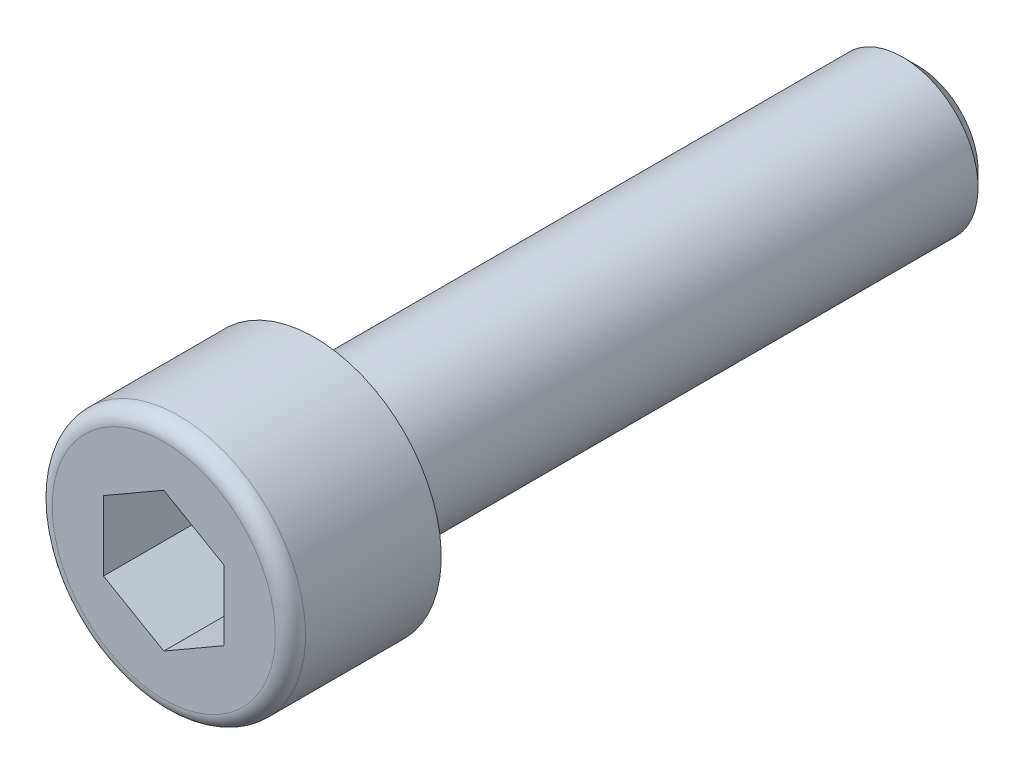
ISO-10303-21;
HEADER;
FILE_DESCRIPTION(('STEP AP214'),'2;1');
FILE_NAME('part.step','',(''),(''),'','','');
FILE_SCHEMA(('AUTOMOTIVE_DESIGN { 1 0 10303 214 1 1 1 1 }'));
ENDSEC;
DATA;
#1=APPLICATION_CONTEXT('core data for automotive mechanical design processes');
#2=APPLICATION_PROTOCOL_DEFINITION('international standard','automotive_design',2000,#1);
#3=PRODUCT_CONTEXT('',#1,'mechanical');
#4=PRODUCT('Part','Part','',(#3));
#5=PRODUCT_RELATED_PRODUCT_CATEGORY('part','',(#4));
#6=PRODUCT_DEFINITION_FORMATION('','',#4);
#7=PRODUCT_DEFINITION_CONTEXT('part definition',#1,'design');
#8=PRODUCT_DEFINITION('design','',#6,#7);
#9=PRODUCT_DEFINITION_SHAPE('','',#8);
#10=(LENGTH_UNIT() NAMED_UNIT(*) SI_UNIT(.MILLI.,.METRE.));
#11=(NAMED_UNIT(*) PLANE_ANGLE_UNIT() SI_UNIT($,.RADIAN.));
#12=(NAMED_UNIT(*) SI_UNIT($,.STERADIAN.) SOLID_ANGLE_UNIT());
#13=UNCERTAINTY_MEASURE_WITH_UNIT(LENGTH_MEASURE(1.E-05),#10,'distance_accuracy_value','');
#14=(GEOMETRIC_REPRESENTATION_CONTEXT(3) GLOBAL_UNCERTAINTY_ASSIGNED_CONTEXT((#13)) GLOBAL_UNIT_ASSIGNED_CONTEXT((#10,
#11,#12)) REPRESENTATION_CONTEXT('',''));
#15=CARTESIAN_POINT('',(0.,0.,0.));
#16=DIRECTION('',(0.,0.,1.));
#17=DIRECTION('',(1.,0.,0.));
#18=AXIS2_PLACEMENT_3D('',#15,#16,#17);
#19=CARTESIAN_POINT('',(0.,0.,0.));
#20=DIRECTION('',(0.,0.,1.));
#21=DIRECTION('',(-0.127409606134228,-0.991850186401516,0.));
#22=AXIS2_PLACEMENT_3D('',#19,#20,#21);
#23=CYLINDRICAL_SURFACE('',#22,4.2);
#24=CARTESIAN_POINT('',(0.,0.,4.5));
#25=DIRECTION('',(0.,0.,-1.));
#26=DIRECTION('',(-1.,0.,0.));
#27=AXIS2_PLACEMENT_3D('',#24,#25,#26);
#28=CIRCLE('',#27,4.2);
#29=CARTESIAN_POINT('',(-4.2,0.,4.5));
#30=VERTEX_POINT('',#29);
#31=EDGE_CURVE('E22',#30,#30,#28,.T.);
#32=ORIENTED_EDGE('',*,*,#31,.T.);
#33=EDGE_LOOP('',(#32));
#34=FACE_BOUND('',#33,.T.);
#35=CARTESIAN_POINT('',(0.,0.,0.));
#36=DIRECTION('',(0.,0.,1.));
#37=DIRECTION('',(-0.127409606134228,-0.991850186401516,0.));
#38=AXIS2_PLACEMENT_3D('',#35,#36,#37);
#39=CIRCLE('',#38,4.2);
#40=CARTESIAN_POINT('',(-0.535120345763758,-4.16577078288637,0.));
#41=VERTEX_POINT('',#40);
#42=EDGE_CURVE('E124',#41,#41,#39,.F.);
#43=ORIENTED_EDGE('',*,*,#42,.F.);
#44=EDGE_LOOP('',(#43));
#45=FACE_BOUND('',#44,.T.);
#46=ADVANCED_FACE('F14',(#34,#45),#23,.T.);
#47=CARTESIAN_POINT('',(0.,0.,0.));
#48=DIRECTION('',(0.,0.,-1.));
#49=DIRECTION('',(0.127409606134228,0.991850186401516,0.));
#50=AXIS2_PLACEMENT_3D('',#47,#48,#49);
#51=PLANE('',#50);
#52=ORIENTED_EDGE('',*,*,#42,.T.);
#53=EDGE_LOOP('',(#52));
#54=FACE_BOUND('',#53,.T.);
#55=CARTESIAN_POINT('',(0.,0.,0.));
#56=DIRECTION('',(0.,0.,-1.));
#57=DIRECTION('',(0.127409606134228,0.991850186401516,0.));
#58=AXIS2_PLACEMENT_3D('',#55,#56,#57);
#59=CIRCLE('',#58,2.5);
#60=CARTESIAN_POINT('',(0.31852401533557,2.47962546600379,0.));
#61=VERTEX_POINT('',#60);
#62=EDGE_CURVE('E116',#61,#61,#59,.T.);
#63=ORIENTED_EDGE('',*,*,#62,.F.);
#64=EDGE_LOOP('',(#63));
#65=FACE_BOUND('',#64,.T.);
#66=ADVANCED_FACE('F153',(#54,#65),#51,.T.);
#67=CARTESIAN_POINT('',(0.,0.,-20.));
#68=DIRECTION('',(0.,0.,-1.));
#69=DIRECTION('',(0.127409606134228,0.991850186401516,0.));
#70=AXIS2_PLACEMENT_3D('',#67,#68,#69);
#71=PLANE('',#70);
#72=CARTESIAN_POINT('',(0.,0.,-20.));
#73=DIRECTION('',(0.,0.,-1.));
#74=DIRECTION('',(0.127409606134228,0.991850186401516,0.));
#75=AXIS2_PLACEMENT_3D('',#72,#73,#74);
#76=CIRCLE('',#75,2.);
#77=CARTESIAN_POINT('',(0.254819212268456,1.98370037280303,-20.));
#78=VERTEX_POINT('',#77);
#79=EDGE_CURVE('E127',#78,#78,#76,.T.);
#80=ORIENTED_EDGE('',*,*,#79,.T.);
#81=EDGE_LOOP('',(#80));
#82=FACE_BOUND('',#81,.T.);
#83=ADVANCED_FACE('F155',(#82),#71,.T.);
#84=CARTESIAN_POINT('',(0.,0.,-20.));
#85=DIRECTION('',(0.,0.,1.));
#86=DIRECTION('',(-0.127409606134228,-0.991850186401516,0.));
#87=AXIS2_PLACEMENT_3D('',#84,#85,#86);
#88=CONICAL_SURFACE('',#87,2.,0.785398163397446);
#89=CARTESIAN_POINT('',(0.,0.,-19.5));
#90=DIRECTION('',(0.,0.,-1.));
#91=DIRECTION('',(0.127409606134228,0.991850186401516,0.));
#92=AXIS2_PLACEMENT_3D('',#89,#90,#91);
#93=CIRCLE('',#92,2.5);
#94=CARTESIAN_POINT('',(0.31852401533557,2.47962546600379,-19.5));
#95=VERTEX_POINT('',#94);
#96=EDGE_CURVE('E130',#95,#95,#93,.F.);
#97=ORIENTED_EDGE('',*,*,#96,.F.);
#98=EDGE_LOOP('',(#97));
#99=FACE_BOUND('',#98,.T.);
#100=ORIENTED_EDGE('',*,*,#79,.F.);
#101=EDGE_LOOP('',(#100));
#102=FACE_BOUND('',#101,.T.);
#103=ADVANCED_FACE('F163',(#99,#102),#88,.T.);
#104=CARTESIAN_POINT('',(0.,0.,-20.));
#105=DIRECTION('',(0.,0.,1.));
#106=DIRECTION('',(-0.127409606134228,-0.991850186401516,0.));
#107=AXIS2_PLACEMENT_3D('',#104,#105,#106);
#108=CYLINDRICAL_SURFACE('',#107,2.5);
#109=ORIENTED_EDGE('',*,*,#96,.T.);
#110=EDGE_LOOP('',(#109));
#111=FACE_BOUND('',#110,.T.);
#112=ORIENTED_EDGE('',*,*,#62,.T.);
#113=EDGE_LOOP('',(#112));
#114=FACE_BOUND('',#113,.T.);
#115=ADVANCED_FACE('F149',(#111,#114),#108,.T.);
#116=CARTESIAN_POINT('',(0.,0.,5.));
#117=DIRECTION('',(0.,0.,-1.));
#118=DIRECTION('',(-1.,0.,0.));
#119=AXIS2_PLACEMENT_3D('',#116,#117,#118);
#120=PLANE('',#119);
#121=DIRECTION('',(-0.866025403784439,-0.5,0.));
#122=VECTOR('',#121,1.);
#123=CARTESIAN_POINT('',(0.,2.30940107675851,5.));
#124=LINE('',#123,#122);
#125=CARTESIAN_POINT('',(0.,2.30940107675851,5.));
#126=VERTEX_POINT('',#125);
#127=CARTESIAN_POINT('',(-2.,1.15470053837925,5.));
#128=VERTEX_POINT('',#127);
#129=EDGE_CURVE('E103',#126,#128,#124,.T.);
#130=ORIENTED_EDGE('',*,*,#129,.F.);
#131=DIRECTION('',(-0.866025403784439,0.5,0.));
#132=VECTOR('',#131,1.);
#133=CARTESIAN_POINT('',(2.,1.15470053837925,5.));
#134=LINE('',#133,#132);
#135=CARTESIAN_POINT('',(2.,1.15470053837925,5.));
#136=VERTEX_POINT('',#135);
#137=EDGE_CURVE('E29',#136,#126,#134,.T.);
#138=ORIENTED_EDGE('',*,*,#137,.F.);
#139=DIRECTION('',(0.,1.,0.));
#140=VECTOR('',#139,1.);
#141=CARTESIAN_POINT('',(2.,-1.15470053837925,5.));
#142=LINE('',#141,#140);
#143=CARTESIAN_POINT('',(2.,-1.15470053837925,5.));
#144=VERTEX_POINT('',#143);
#145=EDGE_CURVE('E112',#144,#136,#142,.T.);
#146=ORIENTED_EDGE('',*,*,#145,.F.);
#147=DIRECTION('',(0.866025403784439,0.5,0.));
#148=VECTOR('',#147,1.);
#149=CARTESIAN_POINT('',(0.,-2.30940107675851,5.));
#150=LINE('',#149,#148);
#151=CARTESIAN_POINT('',(0.,-2.30940107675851,5.));
#152=VERTEX_POINT('',#151);
#153=EDGE_CURVE('E110',#152,#144,#150,.T.);
#154=ORIENTED_EDGE('',*,*,#153,.F.);
#155=DIRECTION('',(0.866025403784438,-0.5,0.));
#156=VECTOR('',#155,1.);
#157=CARTESIAN_POINT('',(-2.,-1.15470053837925,5.));
#158=LINE('',#157,#156);
#159=CARTESIAN_POINT('',(-2.,-1.15470053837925,5.));
#160=VERTEX_POINT('',#159);
#161=EDGE_CURVE('E77',#160,#152,#158,.T.);
#162=ORIENTED_EDGE('',*,*,#161,.F.);
#163=DIRECTION('',(0.,-1.,0.));
#164=VECTOR('',#163,1.);
#165=CARTESIAN_POINT('',(-2.,1.15470053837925,5.));
#166=LINE('',#165,#164);
#167=EDGE_CURVE('E106',#128,#160,#166,.T.);
#168=ORIENTED_EDGE('',*,*,#167,.F.);
#169=EDGE_LOOP('',(#130,#138,#146,#154,#162,#168));
#170=FACE_BOUND('',#169,.T.);
#171=CARTESIAN_POINT('',(0.,0.,5.));
#172=DIRECTION('',(0.,0.,-1.));
#173=DIRECTION('',(-1.,0.,0.));
#174=AXIS2_PLACEMENT_3D('',#171,#172,#173);
#175=CIRCLE('',#174,3.7);
#176=CARTESIAN_POINT('',(-3.7,0.,5.));
#177=VERTEX_POINT('',#176);
#178=EDGE_CURVE('E9',#177,#177,#175,.F.);
#179=ORIENTED_EDGE('',*,*,#178,.T.);
#180=EDGE_LOOP('',(#179));
#181=FACE_BOUND('',#180,.T.);
#182=ADVANCED_FACE('F139',(#170,#181),#120,.F.);
#183=CARTESIAN_POINT('',(0.,0.,4.5));
#184=DIRECTION('',(0.,0.,-1.));
#185=DIRECTION('',(-1.,0.,0.));
#186=AXIS2_PLACEMENT_3D('',#183,#184,#185);
#187=TOROIDAL_SURFACE('',#186,3.7,0.5);
#188=ORIENTED_EDGE('',*,*,#178,.F.);
#189=EDGE_LOOP('',(#188));
#190=FACE_BOUND('',#189,.T.);
#191=ORIENTED_EDGE('',*,*,#31,.F.);
#192=EDGE_LOOP('',(#191));
#193=FACE_BOUND('',#192,.T.);
#194=ADVANCED_FACE('F16',(#190,#193),#187,.T.);
#195=CARTESIAN_POINT('',(2.,1.15470053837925,2.));
#196=DIRECTION('',(0.5,0.866025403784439,0.));
#197=DIRECTION('',(-0.866025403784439,0.5,0.));
#198=AXIS2_PLACEMENT_3D('',#195,#196,#197);
#199=PLANE('',#198);
#200=ORIENTED_EDGE('',*,*,#137,.T.);
#201=DIRECTION('',(0.,0.,1.));
#202=VECTOR('',#201,1.);
#203=CARTESIAN_POINT('',(0.,2.30940107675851,2.));
#204=LINE('',#203,#202);
#205=CARTESIAN_POINT('',(0.,2.30940107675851,2.));
#206=VERTEX_POINT('',#205);
#207=EDGE_CURVE('E59',#206,#126,#204,.T.);
#208=ORIENTED_EDGE('',*,*,#207,.F.);
#209=DIRECTION('',(-0.866025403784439,0.5,0.));
#210=VECTOR('',#209,1.);
#211=CARTESIAN_POINT('',(2.,1.15470053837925,2.));
#212=LINE('',#211,#210);
#213=CARTESIAN_POINT('',(2.,1.15470053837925,2.));
#214=VERTEX_POINT('',#213);
#215=EDGE_CURVE('E114',#214,#206,#212,.T.);
#216=ORIENTED_EDGE('',*,*,#215,.F.);
#217=DIRECTION('',(0.,0.,1.));
#218=VECTOR('',#217,1.);
#219=CARTESIAN_POINT('',(2.,1.15470053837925,2.));
#220=LINE('',#219,#218);
#221=EDGE_CURVE('E37',#214,#136,#220,.T.);
#222=ORIENTED_EDGE('',*,*,#221,.T.);
#223=EDGE_LOOP('',(#200,#208,#216,#222));
#224=FACE_BOUND('',#223,.T.);
#225=ADVANCED_FACE('F138',(#224),#199,.F.);
#226=CARTESIAN_POINT('',(2.,-1.15470053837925,2.));
#227=DIRECTION('',(1.,0.,0.));
#228=DIRECTION('',(0.,0.,-1.));
#229=AXIS2_PLACEMENT_3D('',#226,#227,#228);
#230=PLANE('',#229);
#231=ORIENTED_EDGE('',*,*,#145,.T.);
#232=ORIENTED_EDGE('',*,*,#221,.F.);
#233=DIRECTION('',(0.,1.,0.));
#234=VECTOR('',#233,1.);
#235=CARTESIAN_POINT('',(2.,-1.15470053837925,2.));
#236=LINE('',#235,#234);
#237=CARTESIAN_POINT('',(2.,-1.15470053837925,2.));
#238=VERTEX_POINT('',#237);
#239=EDGE_CURVE('E89',#238,#214,#236,.T.);
#240=ORIENTED_EDGE('',*,*,#239,.F.);
#241=DIRECTION('',(0.,0.,1.));
#242=VECTOR('',#241,1.);
#243=CARTESIAN_POINT('',(2.,-1.15470053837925,2.));
#244=LINE('',#243,#242);
#245=EDGE_CURVE('E81',#238,#144,#244,.T.);
#246=ORIENTED_EDGE('',*,*,#245,.T.);
#247=EDGE_LOOP('',(#231,#232,#240,#246));
#248=FACE_BOUND('',#247,.T.);
#249=ADVANCED_FACE('F147',(#248),#230,.F.);
#250=CARTESIAN_POINT('',(0.,-2.30940107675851,2.));
#251=DIRECTION('',(0.5,-0.866025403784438,0.));
#252=DIRECTION('',(0.866025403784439,0.5,0.));
#253=AXIS2_PLACEMENT_3D('',#250,#251,#252);
#254=PLANE('',#253);
#255=ORIENTED_EDGE('',*,*,#153,.T.);
#256=ORIENTED_EDGE('',*,*,#245,.F.);
#257=DIRECTION('',(0.866025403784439,0.5,0.));
#258=VECTOR('',#257,1.);
#259=CARTESIAN_POINT('',(0.,-2.30940107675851,2.));
#260=LINE('',#259,#258);
#261=CARTESIAN_POINT('',(0.,-2.30940107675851,2.));
#262=VERTEX_POINT('',#261);
#263=EDGE_CURVE('E85',#262,#238,#260,.T.);
#264=ORIENTED_EDGE('',*,*,#263,.F.);
#265=DIRECTION('',(0.,0.,1.));
#266=VECTOR('',#265,1.);
#267=CARTESIAN_POINT('',(0.,-2.30940107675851,2.));
#268=LINE('',#267,#266);
#269=EDGE_CURVE('E70',#262,#152,#268,.T.);
#270=ORIENTED_EDGE('',*,*,#269,.T.);
#271=EDGE_LOOP('',(#255,#256,#264,#270));
#272=FACE_BOUND('',#271,.T.);
#273=ADVANCED_FACE('F86',(#272),#254,.F.);
#274=CARTESIAN_POINT('',(-2.,-1.15470053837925,2.));
#275=DIRECTION('',(-0.5,-0.866025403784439,0.));
#276=DIRECTION('',(0.866025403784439,-0.5,0.));
#277=AXIS2_PLACEMENT_3D('',#274,#275,#276);
#278=PLANE('',#277);
#279=ORIENTED_EDGE('',*,*,#161,.T.);
#280=ORIENTED_EDGE('',*,*,#269,.F.);
#281=DIRECTION('',(0.866025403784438,-0.5,0.));
#282=VECTOR('',#281,1.);
#283=CARTESIAN_POINT('',(-2.,-1.15470053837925,2.));
#284=LINE('',#283,#282);
#285=CARTESIAN_POINT('',(-2.,-1.15470053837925,2.));
#286=VERTEX_POINT('',#285);
#287=EDGE_CURVE('E74',#286,#262,#284,.T.);
#288=ORIENTED_EDGE('',*,*,#287,.F.);
#289=DIRECTION('',(0.,0.,1.));
#290=VECTOR('',#289,1.);
#291=CARTESIAN_POINT('',(-2.,-1.15470053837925,2.));
#292=LINE('',#291,#290);
#293=EDGE_CURVE('E82',#286,#160,#292,.T.);
#294=ORIENTED_EDGE('',*,*,#293,.T.);
#295=EDGE_LOOP('',(#279,#280,#288,#294));
#296=FACE_BOUND('',#295,.T.);
#297=ADVANCED_FACE('F72',(#296),#278,.F.);
#298=CARTESIAN_POINT('',(-2.,1.15470053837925,2.));
#299=DIRECTION('',(-1.,0.,0.));
#300=DIRECTION('',(0.,0.,1.));
#301=AXIS2_PLACEMENT_3D('',#298,#299,#300);
#302=PLANE('',#301);
#303=ORIENTED_EDGE('',*,*,#167,.T.);
#304=ORIENTED_EDGE('',*,*,#293,.F.);
#305=DIRECTION('',(0.,-1.,0.));
#306=VECTOR('',#305,1.);
#307=CARTESIAN_POINT('',(-2.,1.15470053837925,2.));
#308=LINE('',#307,#306);
#309=CARTESIAN_POINT('',(-2.,1.15470053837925,2.));
#310=VERTEX_POINT('',#309);
#311=EDGE_CURVE('E95',#310,#286,#308,.T.);
#312=ORIENTED_EDGE('',*,*,#311,.F.);
#313=DIRECTION('',(0.,0.,1.));
#314=VECTOR('',#313,1.);
#315=CARTESIAN_POINT('',(-2.,1.15470053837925,2.));
#316=LINE('',#315,#314);
#317=EDGE_CURVE('E119',#310,#128,#316,.T.);
#318=ORIENTED_EDGE('',*,*,#317,.T.);
#319=EDGE_LOOP('',(#303,#304,#312,#318));
#320=FACE_BOUND('',#319,.T.);
#321=ADVANCED_FACE('F246',(#320),#302,.F.);
#322=CARTESIAN_POINT('',(0.,2.30940107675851,2.));
#323=DIRECTION('',(-0.5,0.866025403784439,0.));
#324=DIRECTION('',(-0.866025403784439,-0.5,0.));
#325=AXIS2_PLACEMENT_3D('',#322,#323,#324);
#326=PLANE('',#325);
#327=ORIENTED_EDGE('',*,*,#129,.T.);
#328=ORIENTED_EDGE('',*,*,#317,.F.);
#329=DIRECTION('',(-0.866025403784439,-0.5,0.));
#330=VECTOR('',#329,1.);
#331=CARTESIAN_POINT('',(0.,2.30940107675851,2.));
#332=LINE('',#331,#330);
#333=EDGE_CURVE('E97',#206,#310,#332,.T.);
#334=ORIENTED_EDGE('',*,*,#333,.F.);
#335=ORIENTED_EDGE('',*,*,#207,.T.);
#336=EDGE_LOOP('',(#327,#328,#334,#335));
#337=FACE_BOUND('',#336,.T.);
#338=ADVANCED_FACE('F254',(#337),#326,.F.);
#339=CARTESIAN_POINT('',(0.,0.,2.));
#340=DIRECTION('',(0.,0.,1.));
#341=DIRECTION('',(1.,0.,0.));
#342=AXIS2_PLACEMENT_3D('',#339,#340,#341);
#343=PLANE('',#342);
#344=ORIENTED_EDGE('',*,*,#215,.T.);
#345=ORIENTED_EDGE('',*,*,#333,.T.);
#346=ORIENTED_EDGE('',*,*,#311,.T.);
#347=ORIENTED_EDGE('',*,*,#287,.T.);
#348=ORIENTED_EDGE('',*,*,#263,.T.);
#349=ORIENTED_EDGE('',*,*,#239,.T.);
#350=EDGE_LOOP('',(#344,#345,#346,#347,#348,#349));
#351=FACE_BOUND('',#350,.T.);
#352=ADVANCED_FACE('F92',(#351),#343,.T.);
#353=CLOSED_SHELL('',(#46,#66,#83,#103,#115,#182,#194,#225,#249,#273,#297,#321,#338,#352));
#354=MANIFOLD_SOLID_BREP('B1',#353);
#355=ADVANCED_BREP_SHAPE_REPRESENTATION('',(#18,#354),#14);
#356=SHAPE_DEFINITION_REPRESENTATION(#9,#355);
ENDSEC;
END-ISO-10303-21;
